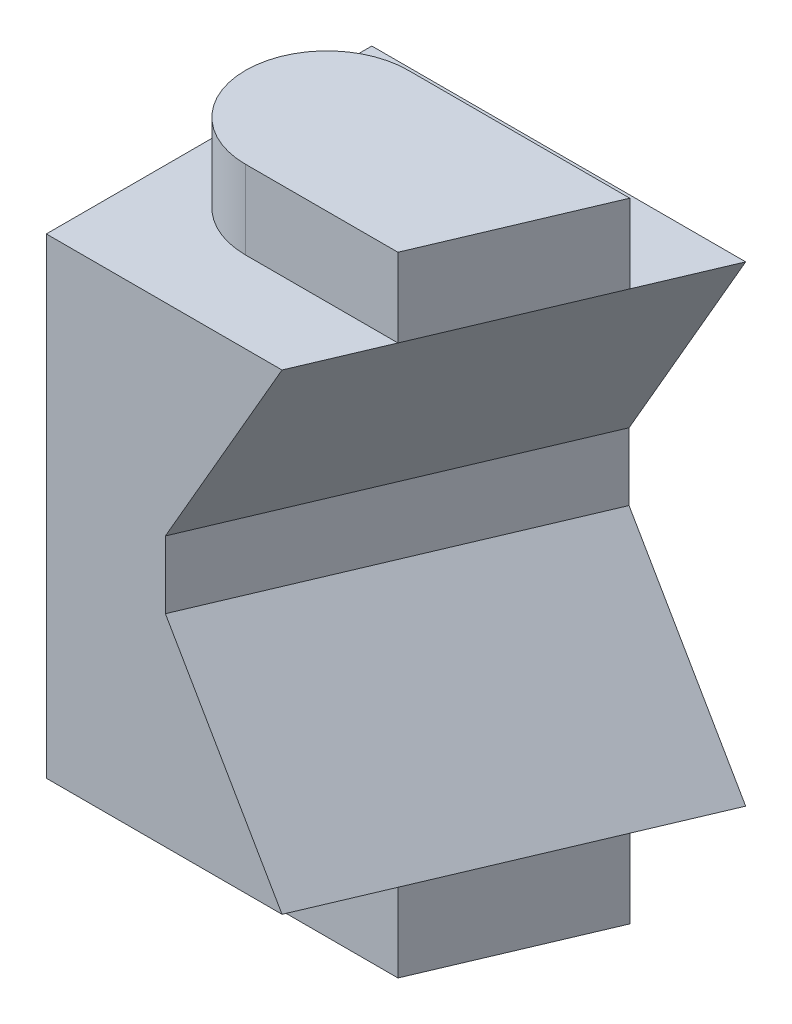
ISO-10303-21;
HEADER;
FILE_DESCRIPTION(('STEP AP214'),'2;1');
FILE_NAME('part.step','',(''),(''),'','','');
FILE_SCHEMA(('AUTOMOTIVE_DESIGN { 1 0 10303 214 1 1 1 1 }'));
ENDSEC;
DATA;
#1=APPLICATION_CONTEXT('core data for automotive mechanical design processes');
#2=APPLICATION_PROTOCOL_DEFINITION('international standard','automotive_design',2000,#1);
#3=PRODUCT_CONTEXT('',#1,'mechanical');
#4=PRODUCT('Part','Part','',(#3));
#5=PRODUCT_RELATED_PRODUCT_CATEGORY('part','',(#4));
#6=PRODUCT_DEFINITION_FORMATION('','',#4);
#7=PRODUCT_DEFINITION_CONTEXT('part definition',#1,'design');
#8=PRODUCT_DEFINITION('design','',#6,#7);
#9=PRODUCT_DEFINITION_SHAPE('','',#8);
#10=(LENGTH_UNIT() NAMED_UNIT(*) SI_UNIT(.MILLI.,.METRE.));
#11=(NAMED_UNIT(*) PLANE_ANGLE_UNIT() SI_UNIT($,.RADIAN.));
#12=(NAMED_UNIT(*) SI_UNIT($,.STERADIAN.) SOLID_ANGLE_UNIT());
#13=UNCERTAINTY_MEASURE_WITH_UNIT(LENGTH_MEASURE(1.E-05),#10,'distance_accuracy_value','');
#14=(GEOMETRIC_REPRESENTATION_CONTEXT(3) GLOBAL_UNCERTAINTY_ASSIGNED_CONTEXT((#13)) GLOBAL_UNIT_ASSIGNED_CONTEXT((#10,
#11,#12)) REPRESENTATION_CONTEXT('',''));
#15=CARTESIAN_POINT('',(0.,0.,0.));
#16=DIRECTION('',(0.,0.,1.));
#17=DIRECTION('',(1.,0.,0.));
#18=AXIS2_PLACEMENT_3D('',#15,#16,#17);
#19=CARTESIAN_POINT('',(0.,21.,0.));
#20=DIRECTION('',(0.,0.,-1.));
#21=DIRECTION('',(-1.,0.,0.));
#22=AXIS2_PLACEMENT_3D('',#19,#20,#21);
#23=PLANE('',#22);
#24=DIRECTION('',(0.,1.,0.));
#25=VECTOR('',#24,1.);
#26=CARTESIAN_POINT('',(22.9174648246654,-3.,0.));
#27=LINE('',#26,#25);
#28=CARTESIAN_POINT('',(22.9174648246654,-3.,0.));
#29=VERTEX_POINT('',#28);
#30=CARTESIAN_POINT('',(22.9174648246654,3.,0.));
#31=VERTEX_POINT('',#30);
#32=EDGE_CURVE('E174',#29,#31,#27,.T.);
#33=ORIENTED_EDGE('',*,*,#32,.F.);
#34=DIRECTION('',(-0.5,0.866025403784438,0.));
#35=VECTOR('',#34,1.);
#36=CARTESIAN_POINT('',(38.0015921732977,-29.1264749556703,0.));
#37=LINE('',#36,#35);
#38=CARTESIAN_POINT('',(33.3097696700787,-21.,0.));
#39=VERTEX_POINT('',#38);
#40=EDGE_CURVE('E171',#39,#29,#37,.T.);
#41=ORIENTED_EDGE('',*,*,#40,.F.);
#42=DIRECTION('',(1.,0.,0.));
#43=VECTOR('',#42,1.);
#44=CARTESIAN_POINT('',(0.,-21.,0.));
#45=LINE('',#44,#43);
#46=CARTESIAN_POINT('',(0.,-21.,0.));
#47=VERTEX_POINT('',#46);
#48=EDGE_CURVE('E191',#47,#39,#45,.T.);
#49=ORIENTED_EDGE('',*,*,#48,.F.);
#50=DIRECTION('',(0.,-1.,0.));
#51=VECTOR('',#50,1.);
#52=CARTESIAN_POINT('',(0.,21.,0.));
#53=LINE('',#52,#51);
#54=CARTESIAN_POINT('',(0.,21.,0.));
#55=VERTEX_POINT('',#54);
#56=EDGE_CURVE('E9',#55,#47,#53,.T.);
#57=ORIENTED_EDGE('',*,*,#56,.F.);
#58=DIRECTION('',(1.,0.,0.));
#59=VECTOR('',#58,1.);
#60=CARTESIAN_POINT('',(0.,21.,0.));
#61=LINE('',#60,#59);
#62=CARTESIAN_POINT('',(33.3097696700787,21.,0.));
#63=VERTEX_POINT('',#62);
#64=EDGE_CURVE('E203',#55,#63,#61,.T.);
#65=ORIENTED_EDGE('',*,*,#64,.T.);
#66=DIRECTION('',(-0.5,-0.866025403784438,0.));
#67=VECTOR('',#66,1.);
#68=CARTESIAN_POINT('',(38.0015921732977,29.1264749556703,0.));
#69=LINE('',#68,#67);
#70=EDGE_CURVE('E176',#63,#31,#69,.T.);
#71=ORIENTED_EDGE('',*,*,#70,.T.);
#72=EDGE_LOOP('',(#33,#41,#49,#57,#65,#71));
#73=FACE_BOUND('',#72,.T.);
#74=ADVANCED_FACE('F14',(#73),#23,.T.);
#75=CARTESIAN_POINT('',(21.,21.,29.));
#76=DIRECTION('',(0.,0.,1.));
#77=DIRECTION('',(1.,0.,0.));
#78=AXIS2_PLACEMENT_3D('',#75,#76,#77);
#79=PLANE('',#78);
#80=DIRECTION('',(-1.,0.,0.));
#81=VECTOR('',#80,1.);
#82=CARTESIAN_POINT('',(21.,-21.,29.));
#83=LINE('',#82,#81);
#84=CARTESIAN_POINT('',(21.,-21.,29.));
#85=VERTEX_POINT('',#84);
#86=CARTESIAN_POINT('',(0.,-21.,29.));
#87=VERTEX_POINT('',#86);
#88=EDGE_CURVE('E198',#85,#87,#83,.T.);
#89=ORIENTED_EDGE('',*,*,#88,.F.);
#90=DIRECTION('',(-0.5,0.866025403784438,0.));
#91=VECTOR('',#90,1.);
#92=CARTESIAN_POINT('',(21.,-21.,29.));
#93=LINE('',#92,#91);
#94=CARTESIAN_POINT('',(10.6076951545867,-3.,29.));
#95=VERTEX_POINT('',#94);
#96=EDGE_CURVE('E169',#85,#95,#93,.T.);
#97=ORIENTED_EDGE('',*,*,#96,.T.);
#98=DIRECTION('',(0.,1.,0.));
#99=VECTOR('',#98,1.);
#100=CARTESIAN_POINT('',(10.6076951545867,-3.,29.));
#101=LINE('',#100,#99);
#102=CARTESIAN_POINT('',(10.6076951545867,3.,29.));
#103=VERTEX_POINT('',#102);
#104=EDGE_CURVE('E184',#95,#103,#101,.T.);
#105=ORIENTED_EDGE('',*,*,#104,.T.);
#106=DIRECTION('',(-0.5,-0.866025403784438,0.));
#107=VECTOR('',#106,1.);
#108=CARTESIAN_POINT('',(21.,21.,29.));
#109=LINE('',#108,#107);
#110=CARTESIAN_POINT('',(21.,21.,29.));
#111=VERTEX_POINT('',#110);
#112=EDGE_CURVE('E180',#111,#103,#109,.T.);
#113=ORIENTED_EDGE('',*,*,#112,.F.);
#114=DIRECTION('',(-1.,0.,0.));
#115=VECTOR('',#114,1.);
#116=CARTESIAN_POINT('',(21.,21.,29.));
#117=LINE('',#116,#115);
#118=CARTESIAN_POINT('',(0.,21.,29.));
#119=VERTEX_POINT('',#118);
#120=EDGE_CURVE('E209',#111,#119,#117,.T.);
#121=ORIENTED_EDGE('',*,*,#120,.T.);
#122=DIRECTION('',(0.,-1.,0.));
#123=VECTOR('',#122,1.);
#124=CARTESIAN_POINT('',(0.,21.,29.));
#125=LINE('',#124,#123);
#126=EDGE_CURVE('E22',#119,#87,#125,.T.);
#127=ORIENTED_EDGE('',*,*,#126,.T.);
#128=EDGE_LOOP('',(#89,#97,#105,#113,#121,#127));
#129=FACE_BOUND('',#128,.T.);
#130=ADVANCED_FACE('F250',(#129),#79,.T.);
#131=CARTESIAN_POINT('',(21.,-21.,29.));
#132=DIRECTION('',(0.,-1.,0.));
#133=DIRECTION('',(0.,0.,-1.));
#134=AXIS2_PLACEMENT_3D('',#131,#132,#133);
#135=PLANE('',#134);
#136=DIRECTION('',(-1.,0.,0.));
#137=VECTOR('',#136,1.);
#138=CARTESIAN_POINT('',(10.5,-21.,21.75));
#139=LINE('',#138,#137);
#140=CARTESIAN_POINT('',(24.0774424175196,-21.,21.75));
#141=VERTEX_POINT('',#140);
#142=CARTESIAN_POINT('',(10.5,-21.,21.75));
#143=VERTEX_POINT('',#142);
#144=EDGE_CURVE('E151',#141,#143,#139,.T.);
#145=ORIENTED_EDGE('',*,*,#144,.F.);
#146=DIRECTION('',(-0.390731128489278,0.,0.920504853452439));
#147=VECTOR('',#146,1.);
#148=CARTESIAN_POINT('',(33.3097696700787,-21.,0.));
#149=LINE('',#148,#147);
#150=EDGE_CURVE('E173',#141,#85,#149,.T.);
#151=ORIENTED_EDGE('',*,*,#150,.T.);
#152=ORIENTED_EDGE('',*,*,#88,.T.);
#153=DIRECTION('',(0.,0.,-1.));
#154=VECTOR('',#153,1.);
#155=CARTESIAN_POINT('',(0.,-21.,29.));
#156=LINE('',#155,#154);
#157=EDGE_CURVE('E195',#87,#47,#156,.T.);
#158=ORIENTED_EDGE('',*,*,#157,.T.);
#159=ORIENTED_EDGE('',*,*,#48,.T.);
#160=CARTESIAN_POINT('',(30.232327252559,-21.,7.25));
#161=VERTEX_POINT('',#160);
#162=EDGE_CURVE('E201',#39,#161,#149,.T.);
#163=ORIENTED_EDGE('',*,*,#162,.T.);
#164=DIRECTION('',(1.,0.,0.));
#165=VECTOR('',#164,1.);
#166=CARTESIAN_POINT('',(10.5,-21.,7.25));
#167=LINE('',#166,#165);
#168=CARTESIAN_POINT('',(10.5,-21.,7.25));
#169=VERTEX_POINT('',#168);
#170=EDGE_CURVE('E159',#169,#161,#167,.T.);
#171=ORIENTED_EDGE('',*,*,#170,.F.);
#172=CARTESIAN_POINT('',(10.5,-21.,14.5));
#173=DIRECTION('',(0.,-1.,0.));
#174=DIRECTION('',(0.,0.,-1.));
#175=AXIS2_PLACEMENT_3D('',#172,#173,#174);
#176=CIRCLE('',#175,7.25);
#177=EDGE_CURVE('E38',#143,#169,#176,.T.);
#178=ORIENTED_EDGE('',*,*,#177,.F.);
#179=EDGE_LOOP('',(#145,#151,#152,#158,#159,#163,#171,#178));
#180=FACE_BOUND('',#179,.T.);
#181=ADVANCED_FACE('F256',(#180),#135,.T.);
#182=CARTESIAN_POINT('',(0.,21.,29.));
#183=DIRECTION('',(-1.,0.,0.));
#184=DIRECTION('',(0.,0.,1.));
#185=AXIS2_PLACEMENT_3D('',#182,#183,#184);
#186=PLANE('',#185);
#187=ORIENTED_EDGE('',*,*,#126,.F.);
#188=DIRECTION('',(0.,0.,-1.));
#189=VECTOR('',#188,1.);
#190=CARTESIAN_POINT('',(0.,21.,29.));
#191=LINE('',#190,#189);
#192=EDGE_CURVE('E206',#119,#55,#191,.T.);
#193=ORIENTED_EDGE('',*,*,#192,.T.);
#194=ORIENTED_EDGE('',*,*,#56,.T.);
#195=ORIENTED_EDGE('',*,*,#157,.F.);
#196=EDGE_LOOP('',(#187,#193,#194,#195));
#197=FACE_BOUND('',#196,.T.);
#198=ADVANCED_FACE('F277',(#197),#186,.T.);
#199=CARTESIAN_POINT('',(21.,21.,29.));
#200=DIRECTION('',(0.,-1.,0.));
#201=DIRECTION('',(0.,0.,-1.));
#202=AXIS2_PLACEMENT_3D('',#199,#200,#201);
#203=PLANE('',#202);
#204=CARTESIAN_POINT('',(10.5,21.,14.5));
#205=DIRECTION('',(0.,-1.,0.));
#206=DIRECTION('',(0.,0.,-1.));
#207=AXIS2_PLACEMENT_3D('',#204,#205,#206);
#208=CIRCLE('',#207,7.25);
#209=CARTESIAN_POINT('',(10.5,21.,21.75));
#210=VERTEX_POINT('',#209);
#211=CARTESIAN_POINT('',(10.5,21.,7.25));
#212=VERTEX_POINT('',#211);
#213=EDGE_CURVE('E30',#210,#212,#208,.T.);
#214=ORIENTED_EDGE('',*,*,#213,.T.);
#215=DIRECTION('',(1.,0.,0.));
#216=VECTOR('',#215,1.);
#217=CARTESIAN_POINT('',(10.5,21.,7.25));
#218=LINE('',#217,#216);
#219=CARTESIAN_POINT('',(30.232327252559,21.,7.25));
#220=VERTEX_POINT('',#219);
#221=EDGE_CURVE('E132',#212,#220,#218,.T.);
#222=ORIENTED_EDGE('',*,*,#221,.T.);
#223=DIRECTION('',(-0.390731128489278,0.,0.920504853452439));
#224=VECTOR('',#223,1.);
#225=CARTESIAN_POINT('',(33.3097696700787,21.,0.));
#226=LINE('',#225,#224);
#227=EDGE_CURVE('E212',#63,#220,#226,.T.);
#228=ORIENTED_EDGE('',*,*,#227,.F.);
#229=ORIENTED_EDGE('',*,*,#64,.F.);
#230=ORIENTED_EDGE('',*,*,#192,.F.);
#231=ORIENTED_EDGE('',*,*,#120,.F.);
#232=CARTESIAN_POINT('',(24.0774424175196,21.,21.75));
#233=VERTEX_POINT('',#232);
#234=EDGE_CURVE('E194',#233,#111,#226,.T.);
#235=ORIENTED_EDGE('',*,*,#234,.F.);
#236=DIRECTION('',(-1.,0.,0.));
#237=VECTOR('',#236,1.);
#238=CARTESIAN_POINT('',(10.5,21.,21.75));
#239=LINE('',#238,#237);
#240=EDGE_CURVE('E142',#233,#210,#239,.T.);
#241=ORIENTED_EDGE('',*,*,#240,.T.);
#242=EDGE_LOOP('',(#214,#222,#228,#229,#230,#231,#235,#241));
#243=FACE_BOUND('',#242,.T.);
#244=ADVANCED_FACE('F235',(#243),#203,.F.);
#245=CARTESIAN_POINT('',(52.0770596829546,-21.,-44.2129645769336));
#246=DIRECTION('',(0.812843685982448,0.469295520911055,0.345031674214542));
#247=DIRECTION('',(-0.5,0.866025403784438,0.));
#248=AXIS2_PLACEMENT_3D('',#245,#246,#247);
#249=PLANE('',#248);
#250=ORIENTED_EDGE('',*,*,#40,.T.);
#251=DIRECTION('',(-0.390731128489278,0.,0.920504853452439));
#252=VECTOR('',#251,1.);
#253=CARTESIAN_POINT('',(41.6847548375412,-3.,-44.2129645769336));
#254=LINE('',#253,#252);
#255=EDGE_CURVE('E179',#29,#95,#254,.T.);
#256=ORIENTED_EDGE('',*,*,#255,.T.);
#257=ORIENTED_EDGE('',*,*,#96,.F.);
#258=ORIENTED_EDGE('',*,*,#150,.F.);
#259=DIRECTION('',(-0.390731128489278,0.,0.920504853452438));
#260=VECTOR('',#259,1.);
#261=CARTESIAN_POINT('',(30.232327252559,-21.,7.25));
#262=LINE('',#261,#260);
#263=EDGE_CURVE('E162',#161,#141,#262,.T.);
#264=ORIENTED_EDGE('',*,*,#263,.F.);
#265=ORIENTED_EDGE('',*,*,#162,.F.);
#266=EDGE_LOOP('',(#250,#256,#257,#258,#264,#265));
#267=FACE_BOUND('',#266,.T.);
#268=ADVANCED_FACE('F272',(#267),#249,.T.);
#269=CARTESIAN_POINT('',(41.6847548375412,-3.,-44.2129645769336));
#270=DIRECTION('',(0.920504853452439,0.,0.390731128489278));
#271=DIRECTION('',(0.390731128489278,0.,-0.920504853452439));
#272=AXIS2_PLACEMENT_3D('',#269,#270,#271);
#273=PLANE('',#272);
#274=ORIENTED_EDGE('',*,*,#32,.T.);
#275=DIRECTION('',(-0.390731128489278,0.,0.920504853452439));
#276=VECTOR('',#275,1.);
#277=CARTESIAN_POINT('',(41.6847548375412,3.,-44.2129645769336));
#278=LINE('',#277,#276);
#279=EDGE_CURVE('E183',#31,#103,#278,.T.);
#280=ORIENTED_EDGE('',*,*,#279,.T.);
#281=ORIENTED_EDGE('',*,*,#104,.F.);
#282=ORIENTED_EDGE('',*,*,#255,.F.);
#283=EDGE_LOOP('',(#274,#280,#281,#282));
#284=FACE_BOUND('',#283,.T.);
#285=ADVANCED_FACE('F265',(#284),#273,.T.);
#286=CARTESIAN_POINT('',(52.0770596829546,21.,-44.2129645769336));
#287=DIRECTION('',(-0.812843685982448,0.469295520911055,-0.345031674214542));
#288=DIRECTION('',(-0.5,-0.866025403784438,0.));
#289=AXIS2_PLACEMENT_3D('',#286,#287,#288);
#290=PLANE('',#289);
#291=ORIENTED_EDGE('',*,*,#227,.T.);
#292=DIRECTION('',(-0.390731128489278,0.,0.920504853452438));
#293=VECTOR('',#292,1.);
#294=CARTESIAN_POINT('',(30.232327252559,21.,7.25));
#295=LINE('',#294,#293);
#296=EDGE_CURVE('E145',#220,#233,#295,.T.);
#297=ORIENTED_EDGE('',*,*,#296,.T.);
#298=ORIENTED_EDGE('',*,*,#234,.T.);
#299=ORIENTED_EDGE('',*,*,#112,.T.);
#300=ORIENTED_EDGE('',*,*,#279,.F.);
#301=ORIENTED_EDGE('',*,*,#70,.F.);
#302=EDGE_LOOP('',(#291,#297,#298,#299,#300,#301));
#303=FACE_BOUND('',#302,.T.);
#304=ADVANCED_FACE('F227',(#303),#290,.F.);
#305=CARTESIAN_POINT('',(10.5,-28.,14.5));
#306=DIRECTION('',(0.,1.,0.));
#307=DIRECTION('',(0.,0.,1.));
#308=AXIS2_PLACEMENT_3D('',#305,#306,#307);
#309=CYLINDRICAL_SURFACE('',#308,7.25);
#310=ORIENTED_EDGE('',*,*,#177,.T.);
#311=DIRECTION('',(0.,1.,0.));
#312=VECTOR('',#311,1.);
#313=CARTESIAN_POINT('',(10.5,-28.,7.25));
#314=LINE('',#313,#312);
#315=CARTESIAN_POINT('',(10.5,-28.,7.25));
#316=VERTEX_POINT('',#315);
#317=EDGE_CURVE('E166',#316,#169,#314,.T.);
#318=ORIENTED_EDGE('',*,*,#317,.F.);
#319=CARTESIAN_POINT('',(10.5,-28.,14.5));
#320=DIRECTION('',(0.,-1.,0.));
#321=DIRECTION('',(0.,0.,-1.));
#322=AXIS2_PLACEMENT_3D('',#319,#320,#321);
#323=CIRCLE('',#322,7.25);
#324=CARTESIAN_POINT('',(10.5,-28.,21.75));
#325=VERTEX_POINT('',#324);
#326=EDGE_CURVE('E147',#325,#316,#323,.T.);
#327=ORIENTED_EDGE('',*,*,#326,.F.);
#328=DIRECTION('',(0.,1.,0.));
#329=VECTOR('',#328,1.);
#330=CARTESIAN_POINT('',(10.5,-28.,21.75));
#331=LINE('',#330,#329);
#332=EDGE_CURVE('E157',#325,#143,#331,.T.);
#333=ORIENTED_EDGE('',*,*,#332,.T.);
#334=EDGE_LOOP('',(#310,#318,#327,#333));
#335=FACE_BOUND('',#334,.T.);
#336=ADVANCED_FACE('F285',(#335),#309,.T.);
#337=CARTESIAN_POINT('',(10.5,-28.,7.25));
#338=DIRECTION('',(0.,0.,1.));
#339=DIRECTION('',(1.,0.,0.));
#340=AXIS2_PLACEMENT_3D('',#337,#338,#339);
#341=PLANE('',#340);
#342=ORIENTED_EDGE('',*,*,#170,.T.);
#343=DIRECTION('',(0.,1.,0.));
#344=VECTOR('',#343,1.);
#345=CARTESIAN_POINT('',(30.232327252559,-28.,7.25));
#346=LINE('',#345,#344);
#347=CARTESIAN_POINT('',(30.232327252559,-28.,7.25));
#348=VERTEX_POINT('',#347);
#349=EDGE_CURVE('E170',#348,#161,#346,.T.);
#350=ORIENTED_EDGE('',*,*,#349,.F.);
#351=DIRECTION('',(1.,0.,0.));
#352=VECTOR('',#351,1.);
#353=CARTESIAN_POINT('',(10.5,-28.,7.25));
#354=LINE('',#353,#352);
#355=EDGE_CURVE('E150',#316,#348,#354,.T.);
#356=ORIENTED_EDGE('',*,*,#355,.F.);
#357=ORIENTED_EDGE('',*,*,#317,.T.);
#358=EDGE_LOOP('',(#342,#350,#356,#357));
#359=FACE_BOUND('',#358,.T.);
#360=ADVANCED_FACE('F294',(#359),#341,.F.);
#361=CARTESIAN_POINT('',(30.232327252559,-28.,7.25));
#362=DIRECTION('',(-0.920504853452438,0.,-0.390731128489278));
#363=DIRECTION('',(-0.390731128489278,0.,0.920504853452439));
#364=AXIS2_PLACEMENT_3D('',#361,#362,#363);
#365=PLANE('',#364);
#366=ORIENTED_EDGE('',*,*,#263,.T.);
#367=DIRECTION('',(0.,1.,0.));
#368=VECTOR('',#367,1.);
#369=CARTESIAN_POINT('',(24.0774424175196,-28.,21.75));
#370=LINE('',#369,#368);
#371=CARTESIAN_POINT('',(24.0774424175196,-28.,21.75));
#372=VERTEX_POINT('',#371);
#373=EDGE_CURVE('E165',#372,#141,#370,.T.);
#374=ORIENTED_EDGE('',*,*,#373,.F.);
#375=DIRECTION('',(-0.390731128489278,0.,0.920504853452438));
#376=VECTOR('',#375,1.);
#377=CARTESIAN_POINT('',(30.232327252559,-28.,7.25));
#378=LINE('',#377,#376);
#379=EDGE_CURVE('E153',#348,#372,#378,.T.);
#380=ORIENTED_EDGE('',*,*,#379,.F.);
#381=ORIENTED_EDGE('',*,*,#349,.T.);
#382=EDGE_LOOP('',(#366,#374,#380,#381));
#383=FACE_BOUND('',#382,.T.);
#384=ADVANCED_FACE('F292',(#383),#365,.F.);
#385=CARTESIAN_POINT('',(10.5,-28.,21.75));
#386=DIRECTION('',(0.,0.,-1.));
#387=DIRECTION('',(-1.,0.,0.));
#388=AXIS2_PLACEMENT_3D('',#385,#386,#387);
#389=PLANE('',#388);
#390=ORIENTED_EDGE('',*,*,#144,.T.);
#391=ORIENTED_EDGE('',*,*,#332,.F.);
#392=DIRECTION('',(-1.,0.,0.));
#393=VECTOR('',#392,1.);
#394=CARTESIAN_POINT('',(10.5,-28.,21.75));
#395=LINE('',#394,#393);
#396=EDGE_CURVE('E155',#372,#325,#395,.T.);
#397=ORIENTED_EDGE('',*,*,#396,.F.);
#398=ORIENTED_EDGE('',*,*,#373,.T.);
#399=EDGE_LOOP('',(#390,#391,#397,#398));
#400=FACE_BOUND('',#399,.T.);
#401=ADVANCED_FACE('F280',(#400),#389,.F.);
#402=CARTESIAN_POINT('',(10.5,-28.,14.5));
#403=DIRECTION('',(0.,-1.,0.));
#404=DIRECTION('',(0.,0.,-1.));
#405=AXIS2_PLACEMENT_3D('',#402,#403,#404);
#406=PLANE('',#405);
#407=ORIENTED_EDGE('',*,*,#326,.T.);
#408=ORIENTED_EDGE('',*,*,#355,.T.);
#409=ORIENTED_EDGE('',*,*,#379,.T.);
#410=ORIENTED_EDGE('',*,*,#396,.T.);
#411=EDGE_LOOP('',(#407,#408,#409,#410));
#412=FACE_BOUND('',#411,.T.);
#413=ADVANCED_FACE('F288',(#412),#406,.T.);
#414=CARTESIAN_POINT('',(10.5,28.,14.5));
#415=DIRECTION('',(0.,-1.,0.));
#416=DIRECTION('',(0.,0.,-1.));
#417=AXIS2_PLACEMENT_3D('',#414,#415,#416);
#418=CYLINDRICAL_SURFACE('',#417,7.25);
#419=ORIENTED_EDGE('',*,*,#213,.F.);
#420=DIRECTION('',(0.,-1.,0.));
#421=VECTOR('',#420,1.);
#422=CARTESIAN_POINT('',(10.5,28.,21.75));
#423=LINE('',#422,#421);
#424=CARTESIAN_POINT('',(10.5,28.,21.75));
#425=VERTEX_POINT('',#424);
#426=EDGE_CURVE('E113',#425,#210,#423,.T.);
#427=ORIENTED_EDGE('',*,*,#426,.F.);
#428=CARTESIAN_POINT('',(10.5,28.,14.5));
#429=DIRECTION('',(0.,-1.,0.));
#430=DIRECTION('',(0.,0.,-1.));
#431=AXIS2_PLACEMENT_3D('',#428,#429,#430);
#432=CIRCLE('',#431,7.25);
#433=CARTESIAN_POINT('',(10.5,28.,7.25));
#434=VERTEX_POINT('',#433);
#435=EDGE_CURVE('E116',#425,#434,#432,.T.);
#436=ORIENTED_EDGE('',*,*,#435,.T.);
#437=DIRECTION('',(0.,-1.,0.));
#438=VECTOR('',#437,1.);
#439=CARTESIAN_POINT('',(10.5,28.,7.25));
#440=LINE('',#439,#438);
#441=EDGE_CURVE('E140',#434,#212,#440,.T.);
#442=ORIENTED_EDGE('',*,*,#441,.T.);
#443=EDGE_LOOP('',(#419,#427,#436,#442));
#444=FACE_BOUND('',#443,.T.);
#445=ADVANCED_FACE('F115',(#444),#418,.T.);
#446=CARTESIAN_POINT('',(10.5,28.,21.75));
#447=DIRECTION('',(0.,0.,1.));
#448=DIRECTION('',(1.,0.,0.));
#449=AXIS2_PLACEMENT_3D('',#446,#447,#448);
#450=PLANE('',#449);
#451=ORIENTED_EDGE('',*,*,#240,.F.);
#452=DIRECTION('',(0.,-1.,0.));
#453=VECTOR('',#452,1.);
#454=CARTESIAN_POINT('',(24.0774424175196,28.,21.75));
#455=LINE('',#454,#453);
#456=CARTESIAN_POINT('',(24.0774424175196,28.,21.75));
#457=VERTEX_POINT('',#456);
#458=EDGE_CURVE('E122',#457,#233,#455,.T.);
#459=ORIENTED_EDGE('',*,*,#458,.F.);
#460=DIRECTION('',(-1.,0.,0.));
#461=VECTOR('',#460,1.);
#462=CARTESIAN_POINT('',(10.5,28.,21.75));
#463=LINE('',#462,#461);
#464=EDGE_CURVE('E128',#457,#425,#463,.T.);
#465=ORIENTED_EDGE('',*,*,#464,.T.);
#466=ORIENTED_EDGE('',*,*,#426,.T.);
#467=EDGE_LOOP('',(#451,#459,#465,#466));
#468=FACE_BOUND('',#467,.T.);
#469=ADVANCED_FACE('F134',(#468),#450,.T.);
#470=CARTESIAN_POINT('',(30.232327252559,28.,7.25));
#471=DIRECTION('',(0.920504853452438,0.,0.390731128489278));
#472=DIRECTION('',(0.390731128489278,0.,-0.920504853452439));
#473=AXIS2_PLACEMENT_3D('',#470,#471,#472);
#474=PLANE('',#473);
#475=ORIENTED_EDGE('',*,*,#296,.F.);
#476=DIRECTION('',(0.,-1.,0.));
#477=VECTOR('',#476,1.);
#478=CARTESIAN_POINT('',(30.232327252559,28.,7.25));
#479=LINE('',#478,#477);
#480=CARTESIAN_POINT('',(30.232327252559,28.,7.25));
#481=VERTEX_POINT('',#480);
#482=EDGE_CURVE('E17',#481,#220,#479,.T.);
#483=ORIENTED_EDGE('',*,*,#482,.F.);
#484=DIRECTION('',(-0.390731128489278,0.,0.920504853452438));
#485=VECTOR('',#484,1.);
#486=CARTESIAN_POINT('',(30.232327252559,28.,7.25));
#487=LINE('',#486,#485);
#488=EDGE_CURVE('E135',#481,#457,#487,.T.);
#489=ORIENTED_EDGE('',*,*,#488,.T.);
#490=ORIENTED_EDGE('',*,*,#458,.T.);
#491=EDGE_LOOP('',(#475,#483,#489,#490));
#492=FACE_BOUND('',#491,.T.);
#493=ADVANCED_FACE('F232',(#492),#474,.T.);
#494=CARTESIAN_POINT('',(10.5,28.,7.25));
#495=DIRECTION('',(0.,0.,-1.));
#496=DIRECTION('',(-1.,0.,0.));
#497=AXIS2_PLACEMENT_3D('',#494,#495,#496);
#498=PLANE('',#497);
#499=ORIENTED_EDGE('',*,*,#221,.F.);
#500=ORIENTED_EDGE('',*,*,#441,.F.);
#501=DIRECTION('',(1.,0.,0.));
#502=VECTOR('',#501,1.);
#503=CARTESIAN_POINT('',(10.5,28.,7.25));
#504=LINE('',#503,#502);
#505=EDGE_CURVE('E131',#434,#481,#504,.T.);
#506=ORIENTED_EDGE('',*,*,#505,.T.);
#507=ORIENTED_EDGE('',*,*,#482,.T.);
#508=EDGE_LOOP('',(#499,#500,#506,#507));
#509=FACE_BOUND('',#508,.T.);
#510=ADVANCED_FACE('F238',(#509),#498,.T.);
#511=CARTESIAN_POINT('',(10.5,28.,14.5));
#512=DIRECTION('',(0.,1.,0.));
#513=DIRECTION('',(0.,0.,-1.));
#514=AXIS2_PLACEMENT_3D('',#511,#512,#513);
#515=PLANE('',#514);
#516=ORIENTED_EDGE('',*,*,#435,.F.);
#517=ORIENTED_EDGE('',*,*,#464,.F.);
#518=ORIENTED_EDGE('',*,*,#488,.F.);
#519=ORIENTED_EDGE('',*,*,#505,.F.);
#520=EDGE_LOOP('',(#516,#517,#518,#519));
#521=FACE_BOUND('',#520,.T.);
#522=ADVANCED_FACE('F126',(#521),#515,.T.);
#523=CLOSED_SHELL('',(#74,#130,#181,#198,#244,#268,#285,#304,#336,#360,#384,#401,#413,#445,#469,
#493,#510,#522));
#524=MANIFOLD_SOLID_BREP('B1',#523);
#525=ADVANCED_BREP_SHAPE_REPRESENTATION('',(#18,#524),#14);
#526=SHAPE_DEFINITION_REPRESENTATION(#9,#525);
ENDSEC;
END-ISO-10303-21;
